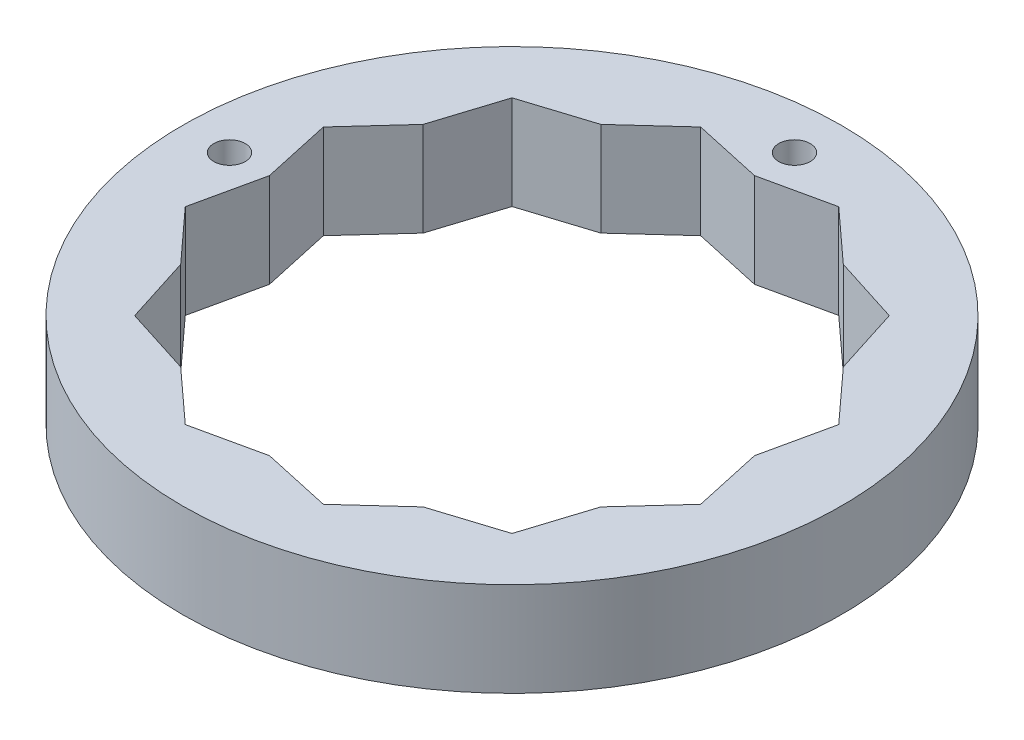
ISO-10303-21;
HEADER;
FILE_DESCRIPTION(('STEP AP214'),'2;1');
FILE_NAME('part.step','',(''),(''),'','','');
FILE_SCHEMA(('AUTOMOTIVE_DESIGN { 1 0 10303 214 1 1 1 1 }'));
ENDSEC;
DATA;
#1=APPLICATION_CONTEXT('core data for automotive mechanical design processes');
#2=APPLICATION_PROTOCOL_DEFINITION('international standard','automotive_design',2000,#1);
#3=PRODUCT_CONTEXT('',#1,'mechanical');
#4=PRODUCT('Part','Part','',(#3));
#5=PRODUCT_RELATED_PRODUCT_CATEGORY('part','',(#4));
#6=PRODUCT_DEFINITION_FORMATION('','',#4);
#7=PRODUCT_DEFINITION_CONTEXT('part definition',#1,'design');
#8=PRODUCT_DEFINITION('design','',#6,#7);
#9=PRODUCT_DEFINITION_SHAPE('','',#8);
#10=(LENGTH_UNIT() NAMED_UNIT(*) SI_UNIT(.MILLI.,.METRE.));
#11=(NAMED_UNIT(*) PLANE_ANGLE_UNIT() SI_UNIT($,.RADIAN.));
#12=(NAMED_UNIT(*) SI_UNIT($,.STERADIAN.) SOLID_ANGLE_UNIT());
#13=UNCERTAINTY_MEASURE_WITH_UNIT(LENGTH_MEASURE(1.E-05),#10,'distance_accuracy_value','');
#14=(GEOMETRIC_REPRESENTATION_CONTEXT(3) GLOBAL_UNCERTAINTY_ASSIGNED_CONTEXT((#13)) GLOBAL_UNIT_ASSIGNED_CONTEXT((#10,
#11,#12)) REPRESENTATION_CONTEXT('',''));
#15=CARTESIAN_POINT('',(0.,0.,0.));
#16=DIRECTION('',(0.,0.,1.));
#17=DIRECTION('',(1.,0.,0.));
#18=AXIS2_PLACEMENT_3D('',#15,#16,#17);
#19=CARTESIAN_POINT('',(0.,3.,0.));
#20=DIRECTION('',(0.,1.,0.));
#21=DIRECTION('',(0.,0.,1.));
#22=AXIS2_PLACEMENT_3D('',#19,#20,#21);
#23=PLANE('',#22);
#24=CARTESIAN_POINT('',(0.,3.,-9.));
#25=DIRECTION('',(0.,1.,0.));
#26=DIRECTION('',(0.,0.,1.));
#27=AXIS2_PLACEMENT_3D('',#24,#25,#26);
#28=CIRCLE('',#27,0.5);
#29=CARTESIAN_POINT('',(0.,3.,-8.5));
#30=VERTEX_POINT('',#29);
#31=EDGE_CURVE('E266',#30,#30,#28,.T.);
#32=ORIENTED_EDGE('',*,*,#31,.F.);
#33=EDGE_LOOP('',(#32));
#34=FACE_BOUND('',#33,.T.);
#35=CARTESIAN_POINT('',(0.,3.,0.));
#36=DIRECTION('',(0.,1.,0.));
#37=DIRECTION('',(0.,0.,1.));
#38=AXIS2_PLACEMENT_3D('',#35,#36,#37);
#39=CIRCLE('',#38,10.5);
#40=CARTESIAN_POINT('',(0.,3.,10.5));
#41=VERTEX_POINT('',#40);
#42=EDGE_CURVE('E11',#41,#41,#39,.T.);
#43=ORIENTED_EDGE('',*,*,#42,.T.);
#44=EDGE_LOOP('',(#43));
#45=FACE_BOUND('',#44,.T.);
#46=DIRECTION('',(-0.976740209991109,0.,0.214426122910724));
#47=VECTOR('',#46,1.);
#48=CARTESIAN_POINT('',(0.,3.,-7.72740661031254));
#49=LINE('',#48,#47);
#50=CARTESIAN_POINT('',(2.19996188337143,3.,-8.21036952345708));
#51=VERTEX_POINT('',#50);
#52=CARTESIAN_POINT('',(0.,3.,-7.72740661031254));
#53=VERTEX_POINT('',#52);
#54=EDGE_CURVE('E205',#51,#53,#49,.T.);
#55=ORIENTED_EDGE('',*,*,#54,.F.);
#56=DIRECTION('',(-0.738668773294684,0.,-0.674068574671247));
#57=VECTOR('',#56,1.);
#58=CARTESIAN_POINT('',(2.19996188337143,3.,-8.21036952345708));
#59=LINE('',#58,#57);
#60=CARTESIAN_POINT('',(3.86370330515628,3.,-6.69213042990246));
#61=VERTEX_POINT('',#60);
#62=EDGE_CURVE('E197',#61,#51,#59,.T.);
#63=ORIENTED_EDGE('',*,*,#62,.F.);
#64=DIRECTION('',(-0.95309489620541,0.,-0.302671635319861));
#65=VECTOR('',#64,1.);
#66=CARTESIAN_POINT('',(3.86370330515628,3.,-6.69213042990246));
#67=LINE('',#66,#65);
#68=CARTESIAN_POINT('',(6.01040764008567,3.,-6.01040764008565));
#69=VERTEX_POINT('',#68);
#70=EDGE_CURVE('E263',#69,#61,#67,.T.);
#71=ORIENTED_EDGE('',*,*,#70,.F.);
#72=DIRECTION('',(-0.302671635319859,0.,-0.953094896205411));
#73=VECTOR('',#72,1.);
#74=CARTESIAN_POINT('',(6.01040764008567,3.,-6.01040764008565));
#75=LINE('',#74,#73);
#76=CARTESIAN_POINT('',(6.69213042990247,3.,-3.86370330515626));
#77=VERTEX_POINT('',#76);
#78=EDGE_CURVE('E261',#77,#69,#75,.T.);
#79=ORIENTED_EDGE('',*,*,#78,.F.);
#80=DIRECTION('',(-0.674068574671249,0.,-0.738668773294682));
#81=VECTOR('',#80,1.);
#82=CARTESIAN_POINT('',(6.69213042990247,3.,-3.86370330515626));
#83=LINE('',#82,#81);
#84=CARTESIAN_POINT('',(8.2103695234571,3.,-2.19996188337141));
#85=VERTEX_POINT('',#84);
#86=EDGE_CURVE('E259',#85,#77,#83,.T.);
#87=ORIENTED_EDGE('',*,*,#86,.F.);
#88=DIRECTION('',(0.214426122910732,0.,-0.976740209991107));
#89=VECTOR('',#88,1.);
#90=CARTESIAN_POINT('',(8.2103695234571,3.,-2.19996188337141));
#91=LINE('',#90,#89);
#92=CARTESIAN_POINT('',(7.72740661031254,3.,0.));
#93=VERTEX_POINT('',#92);
#94=EDGE_CURVE('E257',#93,#85,#91,.T.);
#95=ORIENTED_EDGE('',*,*,#94,.F.);
#96=DIRECTION('',(-0.214426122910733,0.,-0.976740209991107));
#97=VECTOR('',#96,1.);
#98=CARTESIAN_POINT('',(7.72740661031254,3.,0.));
#99=LINE('',#98,#97);
#100=CARTESIAN_POINT('',(8.2103695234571,3.,2.19996188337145));
#101=VERTEX_POINT('',#100);
#102=EDGE_CURVE('E255',#101,#93,#99,.T.);
#103=ORIENTED_EDGE('',*,*,#102,.F.);
#104=DIRECTION('',(0.674068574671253,0.,-0.738668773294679));
#105=VECTOR('',#104,1.);
#106=CARTESIAN_POINT('',(8.2103695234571,3.,2.19996188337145));
#107=LINE('',#106,#105);
#108=CARTESIAN_POINT('',(6.69213042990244,3.,3.8637033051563));
#109=VERTEX_POINT('',#108);
#110=EDGE_CURVE('E253',#109,#101,#107,.T.);
#111=ORIENTED_EDGE('',*,*,#110,.F.);
#112=DIRECTION('',(0.302671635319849,0.,-0.953094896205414));
#113=VECTOR('',#112,1.);
#114=CARTESIAN_POINT('',(6.69213042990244,3.,3.8637033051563));
#115=LINE('',#114,#113);
#116=CARTESIAN_POINT('',(6.01040764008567,3.,6.01040764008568));
#117=VERTEX_POINT('',#116);
#118=EDGE_CURVE('E251',#117,#109,#115,.T.);
#119=ORIENTED_EDGE('',*,*,#118,.F.);
#120=DIRECTION('',(0.953094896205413,0.,-0.302671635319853));
#121=VECTOR('',#120,1.);
#122=CARTESIAN_POINT('',(6.01040764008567,3.,6.01040764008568));
#123=LINE('',#122,#121);
#124=CARTESIAN_POINT('',(3.86370330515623,3.,6.69213042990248));
#125=VERTEX_POINT('',#124);
#126=EDGE_CURVE('E249',#125,#117,#123,.T.);
#127=ORIENTED_EDGE('',*,*,#126,.F.);
#128=DIRECTION('',(0.738668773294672,0.,-0.67406857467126));
#129=VECTOR('',#128,1.);
#130=CARTESIAN_POINT('',(3.86370330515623,3.,6.69213042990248));
#131=LINE('',#130,#129);
#132=CARTESIAN_POINT('',(2.19996188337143,3.,8.21036952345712));
#133=VERTEX_POINT('',#132);
#134=EDGE_CURVE('E247',#133,#125,#131,.T.);
#135=ORIENTED_EDGE('',*,*,#134,.F.);
#136=DIRECTION('',(0.976740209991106,0.,0.214426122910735));
#137=VECTOR('',#136,1.);
#138=CARTESIAN_POINT('',(2.19996188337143,3.,8.21036952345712));
#139=LINE('',#138,#137);
#140=CARTESIAN_POINT('',(0.,3.,7.72740661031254));
#141=VERTEX_POINT('',#140);
#142=EDGE_CURVE('E245',#141,#133,#139,.T.);
#143=ORIENTED_EDGE('',*,*,#142,.F.);
#144=DIRECTION('',(0.976740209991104,0.,-0.214426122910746));
#145=VECTOR('',#144,1.);
#146=CARTESIAN_POINT('',(0.,3.,7.72740661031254));
#147=LINE('',#146,#145);
#148=CARTESIAN_POINT('',(-2.19996188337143,3.,8.21036952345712));
#149=VERTEX_POINT('',#148);
#150=EDGE_CURVE('E243',#149,#141,#147,.T.);
#151=ORIENTED_EDGE('',*,*,#150,.F.);
#152=DIRECTION('',(0.73866877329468,0.,0.674068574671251));
#153=VECTOR('',#152,1.);
#154=CARTESIAN_POINT('',(-2.19996188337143,3.,8.21036952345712));
#155=LINE('',#154,#153);
#156=CARTESIAN_POINT('',(-3.86370330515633,3.,6.69213042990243));
#157=VERTEX_POINT('',#156);
#158=EDGE_CURVE('E241',#157,#149,#155,.T.);
#159=ORIENTED_EDGE('',*,*,#158,.F.);
#160=DIRECTION('',(0.953094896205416,0.,0.302671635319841));
#161=VECTOR('',#160,1.);
#162=CARTESIAN_POINT('',(-3.86370330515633,3.,6.69213042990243));
#163=LINE('',#162,#161);
#164=CARTESIAN_POINT('',(-6.01040764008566,3.,6.01040764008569));
#165=VERTEX_POINT('',#164);
#166=EDGE_CURVE('E239',#165,#157,#163,.T.);
#167=ORIENTED_EDGE('',*,*,#166,.F.);
#168=DIRECTION('',(0.30267163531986,0.,0.95309489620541));
#169=VECTOR('',#168,1.);
#170=CARTESIAN_POINT('',(-6.01040764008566,3.,6.01040764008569));
#171=LINE('',#170,#169);
#172=CARTESIAN_POINT('',(-6.6921304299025,3.,3.86370330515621));
#173=VERTEX_POINT('',#172);
#174=EDGE_CURVE('E237',#173,#165,#171,.T.);
#175=ORIENTED_EDGE('',*,*,#174,.F.);
#176=DIRECTION('',(0.674068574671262,0.,0.738668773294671));
#177=VECTOR('',#176,1.);
#178=CARTESIAN_POINT('',(-6.6921304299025,3.,3.86370330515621));
#179=LINE('',#178,#177);
#180=CARTESIAN_POINT('',(-8.2103695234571,3.,2.19996188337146));
#181=VERTEX_POINT('',#180);
#182=EDGE_CURVE('E235',#181,#173,#179,.T.);
#183=ORIENTED_EDGE('',*,*,#182,.F.);
#184=DIRECTION('',(-0.21442612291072,0.,0.97674020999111));
#185=VECTOR('',#184,1.);
#186=CARTESIAN_POINT('',(-8.2103695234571,3.,2.19996188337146));
#187=LINE('',#186,#185);
#188=CARTESIAN_POINT('',(-7.72740661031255,3.,0.));
#189=VERTEX_POINT('',#188);
#190=EDGE_CURVE('E233',#189,#181,#187,.T.);
#191=ORIENTED_EDGE('',*,*,#190,.F.);
#192=DIRECTION('',(0.214426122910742,0.,0.976740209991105));
#193=VECTOR('',#192,1.);
#194=CARTESIAN_POINT('',(-7.72740661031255,3.,0.));
#195=LINE('',#194,#193);
#196=CARTESIAN_POINT('',(-8.2103695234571,3.,-2.1999618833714));
#197=VERTEX_POINT('',#196);
#198=EDGE_CURVE('E231',#197,#189,#195,.T.);
#199=ORIENTED_EDGE('',*,*,#198,.F.);
#200=DIRECTION('',(-0.67406857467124,0.,0.738668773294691));
#201=VECTOR('',#200,1.);
#202=CARTESIAN_POINT('',(-8.2103695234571,3.,-2.1999618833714));
#203=LINE('',#202,#201);
#204=CARTESIAN_POINT('',(-6.69213042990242,3.,-3.86370330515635));
#205=VERTEX_POINT('',#204);
#206=EDGE_CURVE('E229',#205,#197,#203,.T.);
#207=ORIENTED_EDGE('',*,*,#206,.F.);
#208=DIRECTION('',(-0.302671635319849,0.,0.953094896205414));
#209=VECTOR('',#208,1.);
#210=CARTESIAN_POINT('',(-6.69213042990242,3.,-3.86370330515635));
#211=LINE('',#210,#209);
#212=CARTESIAN_POINT('',(-6.01040764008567,3.,-6.01040764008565));
#213=VERTEX_POINT('',#212);
#214=EDGE_CURVE('E227',#213,#205,#211,.T.);
#215=ORIENTED_EDGE('',*,*,#214,.F.);
#216=DIRECTION('',(-0.953094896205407,0.,0.302671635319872));
#217=VECTOR('',#216,1.);
#218=CARTESIAN_POINT('',(-6.01040764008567,3.,-6.01040764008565));
#219=LINE('',#218,#217);
#220=CARTESIAN_POINT('',(-3.86370330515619,3.,-6.69213042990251));
#221=VERTEX_POINT('',#220);
#222=EDGE_CURVE('E225',#221,#213,#219,.T.);
#223=ORIENTED_EDGE('',*,*,#222,.F.);
#224=DIRECTION('',(-0.738668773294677,0.,0.674068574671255));
#225=VECTOR('',#224,1.);
#226=CARTESIAN_POINT('',(-3.86370330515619,3.,-6.69213042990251));
#227=LINE('',#226,#225);
#228=CARTESIAN_POINT('',(-2.19996188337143,3.,-8.21036952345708));
#229=VERTEX_POINT('',#228);
#230=EDGE_CURVE('E220',#229,#221,#227,.T.);
#231=ORIENTED_EDGE('',*,*,#230,.F.);
#232=DIRECTION('',(-0.976740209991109,0.,-0.214426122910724));
#233=VECTOR('',#232,1.);
#234=CARTESIAN_POINT('',(-2.19996188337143,3.,-8.21036952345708));
#235=LINE('',#234,#233);
#236=EDGE_CURVE('E218',#53,#229,#235,.T.);
#237=ORIENTED_EDGE('',*,*,#236,.F.);
#238=EDGE_LOOP('',(#55,#63,#71,#79,#87,#95,#103,#111,#119,#127,#135,#143,#151,#159,#167,#175,
#183,#191,#199,#207,#215,#223,#231,#237));
#239=FACE_BOUND('',#238,.T.);
#240=CARTESIAN_POINT('',(-9.,3.,0.));
#241=DIRECTION('',(0.,1.,0.));
#242=DIRECTION('',(0.,0.,1.));
#243=AXIS2_PLACEMENT_3D('',#240,#241,#242);
#244=CIRCLE('',#243,0.500000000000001);
#245=CARTESIAN_POINT('',(-9.,3.,0.500000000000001));
#246=VERTEX_POINT('',#245);
#247=EDGE_CURVE('E710',#246,#246,#244,.T.);
#248=ORIENTED_EDGE('',*,*,#247,.F.);
#249=EDGE_LOOP('',(#248));
#250=FACE_BOUND('',#249,.T.);
#251=ADVANCED_FACE('F36',(#34,#45,#239,#250),#23,.T.);
#252=CARTESIAN_POINT('',(0.,0.,0.));
#253=DIRECTION('',(0.,1.,0.));
#254=DIRECTION('',(0.,0.,1.));
#255=AXIS2_PLACEMENT_3D('',#252,#253,#254);
#256=PLANE('',#255);
#257=CARTESIAN_POINT('',(0.,0.,-9.));
#258=DIRECTION('',(0.,1.,0.));
#259=DIRECTION('',(0.,0.,1.));
#260=AXIS2_PLACEMENT_3D('',#257,#258,#259);
#261=CIRCLE('',#260,0.5);
#262=CARTESIAN_POINT('',(0.,0.,-8.5));
#263=VERTEX_POINT('',#262);
#264=EDGE_CURVE('E715',#263,#263,#261,.T.);
#265=ORIENTED_EDGE('',*,*,#264,.T.);
#266=EDGE_LOOP('',(#265));
#267=FACE_BOUND('',#266,.T.);
#268=CARTESIAN_POINT('',(0.,0.,0.));
#269=DIRECTION('',(0.,1.,0.));
#270=DIRECTION('',(0.,0.,1.));
#271=AXIS2_PLACEMENT_3D('',#268,#269,#270);
#272=CIRCLE('',#271,10.5);
#273=CARTESIAN_POINT('',(0.,0.,10.5));
#274=VERTEX_POINT('',#273);
#275=EDGE_CURVE('E40',#274,#274,#272,.T.);
#276=ORIENTED_EDGE('',*,*,#275,.F.);
#277=EDGE_LOOP('',(#276));
#278=FACE_BOUND('',#277,.T.);
#279=DIRECTION('',(-0.738668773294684,0.,-0.674068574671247));
#280=VECTOR('',#279,1.);
#281=CARTESIAN_POINT('',(2.19996188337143,0.,-8.21036952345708));
#282=LINE('',#281,#280);
#283=CARTESIAN_POINT('',(3.86370330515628,0.,-6.69213042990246));
#284=VERTEX_POINT('',#283);
#285=CARTESIAN_POINT('',(2.19996188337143,0.,-8.21036952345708));
#286=VERTEX_POINT('',#285);
#287=EDGE_CURVE('E59',#284,#286,#282,.T.);
#288=ORIENTED_EDGE('',*,*,#287,.T.);
#289=DIRECTION('',(-0.976740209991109,0.,0.214426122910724));
#290=VECTOR('',#289,1.);
#291=CARTESIAN_POINT('',(0.,0.,-7.72740661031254));
#292=LINE('',#291,#290);
#293=CARTESIAN_POINT('',(0.,0.,-7.72740661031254));
#294=VERTEX_POINT('',#293);
#295=EDGE_CURVE('E212',#286,#294,#292,.T.);
#296=ORIENTED_EDGE('',*,*,#295,.T.);
#297=DIRECTION('',(-0.976740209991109,0.,-0.214426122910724));
#298=VECTOR('',#297,1.);
#299=CARTESIAN_POINT('',(-2.19996188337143,0.,-8.21036952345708));
#300=LINE('',#299,#298);
#301=CARTESIAN_POINT('',(-2.19996188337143,0.,-8.21036952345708));
#302=VERTEX_POINT('',#301);
#303=EDGE_CURVE('E268',#294,#302,#300,.T.);
#304=ORIENTED_EDGE('',*,*,#303,.T.);
#305=DIRECTION('',(-0.738668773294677,0.,0.674068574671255));
#306=VECTOR('',#305,1.);
#307=CARTESIAN_POINT('',(-3.86370330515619,0.,-6.69213042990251));
#308=LINE('',#307,#306);
#309=CARTESIAN_POINT('',(-3.86370330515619,0.,-6.69213042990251));
#310=VERTEX_POINT('',#309);
#311=EDGE_CURVE('E271',#302,#310,#308,.T.);
#312=ORIENTED_EDGE('',*,*,#311,.T.);
#313=DIRECTION('',(-0.953094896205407,0.,0.302671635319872));
#314=VECTOR('',#313,1.);
#315=CARTESIAN_POINT('',(-6.01040764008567,0.,-6.01040764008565));
#316=LINE('',#315,#314);
#317=CARTESIAN_POINT('',(-6.01040764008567,0.,-6.01040764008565));
#318=VERTEX_POINT('',#317);
#319=EDGE_CURVE('E274',#310,#318,#316,.T.);
#320=ORIENTED_EDGE('',*,*,#319,.T.);
#321=DIRECTION('',(-0.302671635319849,0.,0.953094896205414));
#322=VECTOR('',#321,1.);
#323=CARTESIAN_POINT('',(-6.69213042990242,0.,-3.86370330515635));
#324=LINE('',#323,#322);
#325=CARTESIAN_POINT('',(-6.69213042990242,0.,-3.86370330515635));
#326=VERTEX_POINT('',#325);
#327=EDGE_CURVE('E277',#318,#326,#324,.T.);
#328=ORIENTED_EDGE('',*,*,#327,.T.);
#329=DIRECTION('',(-0.67406857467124,0.,0.738668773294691));
#330=VECTOR('',#329,1.);
#331=CARTESIAN_POINT('',(-8.2103695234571,0.,-2.1999618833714));
#332=LINE('',#331,#330);
#333=CARTESIAN_POINT('',(-8.2103695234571,0.,-2.1999618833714));
#334=VERTEX_POINT('',#333);
#335=EDGE_CURVE('E280',#326,#334,#332,.T.);
#336=ORIENTED_EDGE('',*,*,#335,.T.);
#337=DIRECTION('',(0.214426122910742,0.,0.976740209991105));
#338=VECTOR('',#337,1.);
#339=CARTESIAN_POINT('',(-7.72740661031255,0.,0.));
#340=LINE('',#339,#338);
#341=CARTESIAN_POINT('',(-7.72740661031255,0.,0.));
#342=VERTEX_POINT('',#341);
#343=EDGE_CURVE('E283',#334,#342,#340,.T.);
#344=ORIENTED_EDGE('',*,*,#343,.T.);
#345=DIRECTION('',(-0.21442612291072,0.,0.97674020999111));
#346=VECTOR('',#345,1.);
#347=CARTESIAN_POINT('',(-8.2103695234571,0.,2.19996188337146));
#348=LINE('',#347,#346);
#349=CARTESIAN_POINT('',(-8.2103695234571,0.,2.19996188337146));
#350=VERTEX_POINT('',#349);
#351=EDGE_CURVE('E286',#342,#350,#348,.T.);
#352=ORIENTED_EDGE('',*,*,#351,.T.);
#353=DIRECTION('',(0.674068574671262,0.,0.738668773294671));
#354=VECTOR('',#353,1.);
#355=CARTESIAN_POINT('',(-6.6921304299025,0.,3.86370330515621));
#356=LINE('',#355,#354);
#357=CARTESIAN_POINT('',(-6.6921304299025,0.,3.86370330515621));
#358=VERTEX_POINT('',#357);
#359=EDGE_CURVE('E289',#350,#358,#356,.T.);
#360=ORIENTED_EDGE('',*,*,#359,.T.);
#361=DIRECTION('',(0.30267163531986,0.,0.95309489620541));
#362=VECTOR('',#361,1.);
#363=CARTESIAN_POINT('',(-6.01040764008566,0.,6.01040764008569));
#364=LINE('',#363,#362);
#365=CARTESIAN_POINT('',(-6.01040764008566,0.,6.01040764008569));
#366=VERTEX_POINT('',#365);
#367=EDGE_CURVE('E292',#358,#366,#364,.T.);
#368=ORIENTED_EDGE('',*,*,#367,.T.);
#369=DIRECTION('',(0.953094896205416,0.,0.302671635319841));
#370=VECTOR('',#369,1.);
#371=CARTESIAN_POINT('',(-3.86370330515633,0.,6.69213042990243));
#372=LINE('',#371,#370);
#373=CARTESIAN_POINT('',(-3.86370330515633,0.,6.69213042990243));
#374=VERTEX_POINT('',#373);
#375=EDGE_CURVE('E295',#366,#374,#372,.T.);
#376=ORIENTED_EDGE('',*,*,#375,.T.);
#377=DIRECTION('',(0.73866877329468,0.,0.674068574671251));
#378=VECTOR('',#377,1.);
#379=CARTESIAN_POINT('',(-2.19996188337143,0.,8.21036952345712));
#380=LINE('',#379,#378);
#381=CARTESIAN_POINT('',(-2.19996188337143,0.,8.21036952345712));
#382=VERTEX_POINT('',#381);
#383=EDGE_CURVE('E298',#374,#382,#380,.T.);
#384=ORIENTED_EDGE('',*,*,#383,.T.);
#385=DIRECTION('',(0.976740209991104,0.,-0.214426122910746));
#386=VECTOR('',#385,1.);
#387=CARTESIAN_POINT('',(0.,0.,7.72740661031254));
#388=LINE('',#387,#386);
#389=CARTESIAN_POINT('',(0.,0.,7.72740661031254));
#390=VERTEX_POINT('',#389);
#391=EDGE_CURVE('E301',#382,#390,#388,.T.);
#392=ORIENTED_EDGE('',*,*,#391,.T.);
#393=DIRECTION('',(0.976740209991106,0.,0.214426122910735));
#394=VECTOR('',#393,1.);
#395=CARTESIAN_POINT('',(2.19996188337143,0.,8.21036952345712));
#396=LINE('',#395,#394);
#397=CARTESIAN_POINT('',(2.19996188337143,0.,8.21036952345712));
#398=VERTEX_POINT('',#397);
#399=EDGE_CURVE('E304',#390,#398,#396,.T.);
#400=ORIENTED_EDGE('',*,*,#399,.T.);
#401=DIRECTION('',(0.738668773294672,0.,-0.67406857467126));
#402=VECTOR('',#401,1.);
#403=CARTESIAN_POINT('',(3.86370330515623,0.,6.69213042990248));
#404=LINE('',#403,#402);
#405=CARTESIAN_POINT('',(3.86370330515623,0.,6.69213042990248));
#406=VERTEX_POINT('',#405);
#407=EDGE_CURVE('E307',#398,#406,#404,.T.);
#408=ORIENTED_EDGE('',*,*,#407,.T.);
#409=DIRECTION('',(0.953094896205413,0.,-0.302671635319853));
#410=VECTOR('',#409,1.);
#411=CARTESIAN_POINT('',(6.01040764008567,0.,6.01040764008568));
#412=LINE('',#411,#410);
#413=CARTESIAN_POINT('',(6.01040764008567,0.,6.01040764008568));
#414=VERTEX_POINT('',#413);
#415=EDGE_CURVE('E310',#406,#414,#412,.T.);
#416=ORIENTED_EDGE('',*,*,#415,.T.);
#417=DIRECTION('',(0.302671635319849,0.,-0.953094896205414));
#418=VECTOR('',#417,1.);
#419=CARTESIAN_POINT('',(6.69213042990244,0.,3.8637033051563));
#420=LINE('',#419,#418);
#421=CARTESIAN_POINT('',(6.69213042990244,0.,3.8637033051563));
#422=VERTEX_POINT('',#421);
#423=EDGE_CURVE('E313',#414,#422,#420,.T.);
#424=ORIENTED_EDGE('',*,*,#423,.T.);
#425=DIRECTION('',(0.674068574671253,0.,-0.738668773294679));
#426=VECTOR('',#425,1.);
#427=CARTESIAN_POINT('',(8.2103695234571,0.,2.19996188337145));
#428=LINE('',#427,#426);
#429=CARTESIAN_POINT('',(8.2103695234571,0.,2.19996188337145));
#430=VERTEX_POINT('',#429);
#431=EDGE_CURVE('E316',#422,#430,#428,.T.);
#432=ORIENTED_EDGE('',*,*,#431,.T.);
#433=DIRECTION('',(-0.214426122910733,0.,-0.976740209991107));
#434=VECTOR('',#433,1.);
#435=CARTESIAN_POINT('',(7.72740661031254,0.,0.));
#436=LINE('',#435,#434);
#437=CARTESIAN_POINT('',(7.72740661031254,0.,0.));
#438=VERTEX_POINT('',#437);
#439=EDGE_CURVE('E319',#430,#438,#436,.T.);
#440=ORIENTED_EDGE('',*,*,#439,.T.);
#441=DIRECTION('',(0.214426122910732,0.,-0.976740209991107));
#442=VECTOR('',#441,1.);
#443=CARTESIAN_POINT('',(8.2103695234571,0.,-2.19996188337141));
#444=LINE('',#443,#442);
#445=CARTESIAN_POINT('',(8.2103695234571,0.,-2.19996188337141));
#446=VERTEX_POINT('',#445);
#447=EDGE_CURVE('E322',#438,#446,#444,.T.);
#448=ORIENTED_EDGE('',*,*,#447,.T.);
#449=DIRECTION('',(-0.674068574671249,0.,-0.738668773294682));
#450=VECTOR('',#449,1.);
#451=CARTESIAN_POINT('',(6.69213042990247,0.,-3.86370330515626));
#452=LINE('',#451,#450);
#453=CARTESIAN_POINT('',(6.69213042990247,0.,-3.86370330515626));
#454=VERTEX_POINT('',#453);
#455=EDGE_CURVE('E325',#446,#454,#452,.T.);
#456=ORIENTED_EDGE('',*,*,#455,.T.);
#457=DIRECTION('',(-0.302671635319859,0.,-0.953094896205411));
#458=VECTOR('',#457,1.);
#459=CARTESIAN_POINT('',(6.01040764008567,0.,-6.01040764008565));
#460=LINE('',#459,#458);
#461=CARTESIAN_POINT('',(6.01040764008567,0.,-6.01040764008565));
#462=VERTEX_POINT('',#461);
#463=EDGE_CURVE('E328',#454,#462,#460,.T.);
#464=ORIENTED_EDGE('',*,*,#463,.T.);
#465=DIRECTION('',(-0.95309489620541,0.,-0.302671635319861));
#466=VECTOR('',#465,1.);
#467=CARTESIAN_POINT('',(3.86370330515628,0.,-6.69213042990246));
#468=LINE('',#467,#466);
#469=EDGE_CURVE('E206',#462,#284,#468,.T.);
#470=ORIENTED_EDGE('',*,*,#469,.T.);
#471=EDGE_LOOP('',(#288,#296,#304,#312,#320,#328,#336,#344,#352,#360,#368,#376,#384,#392,#400,
#408,#416,#424,#432,#440,#448,#456,#464,#470));
#472=FACE_BOUND('',#471,.T.);
#473=CARTESIAN_POINT('',(-9.,0.,0.));
#474=DIRECTION('',(0.,1.,0.));
#475=DIRECTION('',(0.,0.,1.));
#476=AXIS2_PLACEMENT_3D('',#473,#474,#475);
#477=CIRCLE('',#476,0.500000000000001);
#478=CARTESIAN_POINT('',(-9.,0.,0.500000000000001));
#479=VERTEX_POINT('',#478);
#480=EDGE_CURVE('E713',#479,#479,#477,.T.);
#481=ORIENTED_EDGE('',*,*,#480,.T.);
#482=EDGE_LOOP('',(#481));
#483=FACE_BOUND('',#482,.T.);
#484=ADVANCED_FACE('F381',(#267,#278,#472,#483),#256,.F.);
#485=CARTESIAN_POINT('',(0.,3.,0.));
#486=DIRECTION('',(0.,-1.,0.));
#487=DIRECTION('',(0.,0.,-1.));
#488=AXIS2_PLACEMENT_3D('',#485,#486,#487);
#489=CYLINDRICAL_SURFACE('',#488,10.5);
#490=ORIENTED_EDGE('',*,*,#42,.F.);
#491=EDGE_LOOP('',(#490));
#492=FACE_BOUND('',#491,.T.);
#493=ORIENTED_EDGE('',*,*,#275,.T.);
#494=EDGE_LOOP('',(#493));
#495=FACE_BOUND('',#494,.T.);
#496=ADVANCED_FACE('F38',(#492,#495),#489,.T.);
#497=CARTESIAN_POINT('',(2.19996188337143,3.,-8.21036952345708));
#498=DIRECTION('',(-0.674068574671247,0.,0.738668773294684));
#499=DIRECTION('',(0.738668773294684,0.,0.674068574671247));
#500=AXIS2_PLACEMENT_3D('',#497,#498,#499);
#501=PLANE('',#500);
#502=ORIENTED_EDGE('',*,*,#287,.F.);
#503=DIRECTION('',(0.,-1.,0.));
#504=VECTOR('',#503,1.);
#505=CARTESIAN_POINT('',(3.86370330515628,3.,-6.69213042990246));
#506=LINE('',#505,#504);
#507=EDGE_CURVE('E201',#61,#284,#506,.T.);
#508=ORIENTED_EDGE('',*,*,#507,.F.);
#509=ORIENTED_EDGE('',*,*,#62,.T.);
#510=DIRECTION('',(0.,-1.,0.));
#511=VECTOR('',#510,1.);
#512=CARTESIAN_POINT('',(2.19996188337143,3.,-8.21036952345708));
#513=LINE('',#512,#511);
#514=EDGE_CURVE('E200',#51,#286,#513,.T.);
#515=ORIENTED_EDGE('',*,*,#514,.T.);
#516=EDGE_LOOP('',(#502,#508,#509,#515));
#517=FACE_BOUND('',#516,.T.);
#518=ADVANCED_FACE('F199',(#517),#501,.T.);
#519=CARTESIAN_POINT('',(0.,3.,-7.72740661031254));
#520=DIRECTION('',(0.214426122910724,0.,0.976740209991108));
#521=DIRECTION('',(0.976740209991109,0.,-0.214426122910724));
#522=AXIS2_PLACEMENT_3D('',#519,#520,#521);
#523=PLANE('',#522);
#524=ORIENTED_EDGE('',*,*,#295,.F.);
#525=ORIENTED_EDGE('',*,*,#514,.F.);
#526=ORIENTED_EDGE('',*,*,#54,.T.);
#527=DIRECTION('',(0.,-1.,0.));
#528=VECTOR('',#527,1.);
#529=CARTESIAN_POINT('',(0.,3.,-7.72740661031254));
#530=LINE('',#529,#528);
#531=EDGE_CURVE('E213',#53,#294,#530,.T.);
#532=ORIENTED_EDGE('',*,*,#531,.T.);
#533=EDGE_LOOP('',(#524,#525,#526,#532));
#534=FACE_BOUND('',#533,.T.);
#535=ADVANCED_FACE('F209',(#534),#523,.T.);
#536=CARTESIAN_POINT('',(-2.19996188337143,3.,-8.21036952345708));
#537=DIRECTION('',(-0.214426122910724,0.,0.976740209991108));
#538=DIRECTION('',(0.976740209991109,0.,0.214426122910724));
#539=AXIS2_PLACEMENT_3D('',#536,#537,#538);
#540=PLANE('',#539);
#541=ORIENTED_EDGE('',*,*,#303,.F.);
#542=ORIENTED_EDGE('',*,*,#531,.F.);
#543=ORIENTED_EDGE('',*,*,#236,.T.);
#544=DIRECTION('',(0.,-1.,0.));
#545=VECTOR('',#544,1.);
#546=CARTESIAN_POINT('',(-2.19996188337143,3.,-8.21036952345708));
#547=LINE('',#546,#545);
#548=EDGE_CURVE('E373',#229,#302,#547,.T.);
#549=ORIENTED_EDGE('',*,*,#548,.T.);
#550=EDGE_LOOP('',(#541,#542,#543,#549));
#551=FACE_BOUND('',#550,.T.);
#552=ADVANCED_FACE('F377',(#551),#540,.T.);
#553=CARTESIAN_POINT('',(-3.86370330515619,3.,-6.69213042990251));
#554=DIRECTION('',(0.674068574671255,0.,0.738668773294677));
#555=DIRECTION('',(0.738668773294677,0.,-0.674068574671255));
#556=AXIS2_PLACEMENT_3D('',#553,#554,#555);
#557=PLANE('',#556);
#558=ORIENTED_EDGE('',*,*,#311,.F.);
#559=ORIENTED_EDGE('',*,*,#548,.F.);
#560=ORIENTED_EDGE('',*,*,#230,.T.);
#561=DIRECTION('',(0.,-1.,0.));
#562=VECTOR('',#561,1.);
#563=CARTESIAN_POINT('',(-3.86370330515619,3.,-6.69213042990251));
#564=LINE('',#563,#562);
#565=EDGE_CURVE('E371',#221,#310,#564,.T.);
#566=ORIENTED_EDGE('',*,*,#565,.T.);
#567=EDGE_LOOP('',(#558,#559,#560,#566));
#568=FACE_BOUND('',#567,.T.);
#569=ADVANCED_FACE('F480',(#568),#557,.T.);
#570=CARTESIAN_POINT('',(-6.01040764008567,3.,-6.01040764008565));
#571=DIRECTION('',(0.302671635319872,0.,0.953094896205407));
#572=DIRECTION('',(0.953094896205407,0.,-0.302671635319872));
#573=AXIS2_PLACEMENT_3D('',#570,#571,#572);
#574=PLANE('',#573);
#575=ORIENTED_EDGE('',*,*,#319,.F.);
#576=ORIENTED_EDGE('',*,*,#565,.F.);
#577=ORIENTED_EDGE('',*,*,#222,.T.);
#578=DIRECTION('',(0.,-1.,0.));
#579=VECTOR('',#578,1.);
#580=CARTESIAN_POINT('',(-6.01040764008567,3.,-6.01040764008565));
#581=LINE('',#580,#579);
#582=EDGE_CURVE('E369',#213,#318,#581,.T.);
#583=ORIENTED_EDGE('',*,*,#582,.T.);
#584=EDGE_LOOP('',(#575,#576,#577,#583));
#585=FACE_BOUND('',#584,.T.);
#586=ADVANCED_FACE('F478',(#585),#574,.T.);
#587=CARTESIAN_POINT('',(-6.69213042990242,3.,-3.86370330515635));
#588=DIRECTION('',(0.953094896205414,0.,0.302671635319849));
#589=DIRECTION('',(0.302671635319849,0.,-0.953094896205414));
#590=AXIS2_PLACEMENT_3D('',#587,#588,#589);
#591=PLANE('',#590);
#592=ORIENTED_EDGE('',*,*,#327,.F.);
#593=ORIENTED_EDGE('',*,*,#582,.F.);
#594=ORIENTED_EDGE('',*,*,#214,.T.);
#595=DIRECTION('',(0.,-1.,0.));
#596=VECTOR('',#595,1.);
#597=CARTESIAN_POINT('',(-6.69213042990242,3.,-3.86370330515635));
#598=LINE('',#597,#596);
#599=EDGE_CURVE('E367',#205,#326,#598,.T.);
#600=ORIENTED_EDGE('',*,*,#599,.T.);
#601=EDGE_LOOP('',(#592,#593,#594,#600));
#602=FACE_BOUND('',#601,.T.);
#603=ADVANCED_FACE('F472',(#602),#591,.T.);
#604=CARTESIAN_POINT('',(-8.2103695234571,3.,-2.1999618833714));
#605=DIRECTION('',(0.738668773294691,0.,0.67406857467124));
#606=DIRECTION('',(0.67406857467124,0.,-0.738668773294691));
#607=AXIS2_PLACEMENT_3D('',#604,#605,#606);
#608=PLANE('',#607);
#609=ORIENTED_EDGE('',*,*,#335,.F.);
#610=ORIENTED_EDGE('',*,*,#599,.F.);
#611=ORIENTED_EDGE('',*,*,#206,.T.);
#612=DIRECTION('',(0.,-1.,0.));
#613=VECTOR('',#612,1.);
#614=CARTESIAN_POINT('',(-8.2103695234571,3.,-2.1999618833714));
#615=LINE('',#614,#613);
#616=EDGE_CURVE('E365',#197,#334,#615,.T.);
#617=ORIENTED_EDGE('',*,*,#616,.T.);
#618=EDGE_LOOP('',(#609,#610,#611,#617));
#619=FACE_BOUND('',#618,.T.);
#620=ADVANCED_FACE('F468',(#619),#608,.T.);
#621=CARTESIAN_POINT('',(-7.72740661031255,3.,0.));
#622=DIRECTION('',(0.976740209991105,0.,-0.214426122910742));
#623=DIRECTION('',(-0.214426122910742,0.,-0.976740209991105));
#624=AXIS2_PLACEMENT_3D('',#621,#622,#623);
#625=PLANE('',#624);
#626=ORIENTED_EDGE('',*,*,#343,.F.);
#627=ORIENTED_EDGE('',*,*,#616,.F.);
#628=ORIENTED_EDGE('',*,*,#198,.T.);
#629=DIRECTION('',(0.,-1.,0.));
#630=VECTOR('',#629,1.);
#631=CARTESIAN_POINT('',(-7.72740661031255,3.,0.));
#632=LINE('',#631,#630);
#633=EDGE_CURVE('E363',#189,#342,#632,.T.);
#634=ORIENTED_EDGE('',*,*,#633,.T.);
#635=EDGE_LOOP('',(#626,#627,#628,#634));
#636=FACE_BOUND('',#635,.T.);
#637=ADVANCED_FACE('F465',(#636),#625,.T.);
#638=CARTESIAN_POINT('',(-8.2103695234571,3.,2.19996188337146));
#639=DIRECTION('',(0.976740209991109,0.,0.21442612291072));
#640=DIRECTION('',(0.21442612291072,0.,-0.97674020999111));
#641=AXIS2_PLACEMENT_3D('',#638,#639,#640);
#642=PLANE('',#641);
#643=ORIENTED_EDGE('',*,*,#351,.F.);
#644=ORIENTED_EDGE('',*,*,#633,.F.);
#645=ORIENTED_EDGE('',*,*,#190,.T.);
#646=DIRECTION('',(0.,-1.,0.));
#647=VECTOR('',#646,1.);
#648=CARTESIAN_POINT('',(-8.2103695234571,3.,2.19996188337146));
#649=LINE('',#648,#647);
#650=EDGE_CURVE('E361',#181,#350,#649,.T.);
#651=ORIENTED_EDGE('',*,*,#650,.T.);
#652=EDGE_LOOP('',(#643,#644,#645,#651));
#653=FACE_BOUND('',#652,.T.);
#654=ADVANCED_FACE('F457',(#653),#642,.T.);
#655=CARTESIAN_POINT('',(-6.6921304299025,3.,3.86370330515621));
#656=DIRECTION('',(0.738668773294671,0.,-0.674068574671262));
#657=DIRECTION('',(-0.674068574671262,0.,-0.738668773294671));
#658=AXIS2_PLACEMENT_3D('',#655,#656,#657);
#659=PLANE('',#658);
#660=ORIENTED_EDGE('',*,*,#359,.F.);
#661=ORIENTED_EDGE('',*,*,#650,.F.);
#662=ORIENTED_EDGE('',*,*,#182,.T.);
#663=DIRECTION('',(0.,-1.,0.));
#664=VECTOR('',#663,1.);
#665=CARTESIAN_POINT('',(-6.6921304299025,3.,3.86370330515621));
#666=LINE('',#665,#664);
#667=EDGE_CURVE('E359',#173,#358,#666,.T.);
#668=ORIENTED_EDGE('',*,*,#667,.T.);
#669=EDGE_LOOP('',(#660,#661,#662,#668));
#670=FACE_BOUND('',#669,.T.);
#671=ADVANCED_FACE('F453',(#670),#659,.T.);
#672=CARTESIAN_POINT('',(-6.01040764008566,3.,6.01040764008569));
#673=DIRECTION('',(0.95309489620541,0.,-0.30267163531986));
#674=DIRECTION('',(-0.30267163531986,0.,-0.95309489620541));
#675=AXIS2_PLACEMENT_3D('',#672,#673,#674);
#676=PLANE('',#675);
#677=ORIENTED_EDGE('',*,*,#367,.F.);
#678=ORIENTED_EDGE('',*,*,#667,.F.);
#679=ORIENTED_EDGE('',*,*,#174,.T.);
#680=DIRECTION('',(0.,-1.,0.));
#681=VECTOR('',#680,1.);
#682=CARTESIAN_POINT('',(-6.01040764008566,3.,6.01040764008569));
#683=LINE('',#682,#681);
#684=EDGE_CURVE('E357',#165,#366,#683,.T.);
#685=ORIENTED_EDGE('',*,*,#684,.T.);
#686=EDGE_LOOP('',(#677,#678,#679,#685));
#687=FACE_BOUND('',#686,.T.);
#688=ADVANCED_FACE('F450',(#687),#676,.T.);
#689=CARTESIAN_POINT('',(-3.86370330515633,3.,6.69213042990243));
#690=DIRECTION('',(0.302671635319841,0.,-0.953094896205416));
#691=DIRECTION('',(-0.953094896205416,0.,-0.302671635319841));
#692=AXIS2_PLACEMENT_3D('',#689,#690,#691);
#693=PLANE('',#692);
#694=ORIENTED_EDGE('',*,*,#375,.F.);
#695=ORIENTED_EDGE('',*,*,#684,.F.);
#696=ORIENTED_EDGE('',*,*,#166,.T.);
#697=DIRECTION('',(0.,-1.,0.));
#698=VECTOR('',#697,1.);
#699=CARTESIAN_POINT('',(-3.86370330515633,3.,6.69213042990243));
#700=LINE('',#699,#698);
#701=EDGE_CURVE('E355',#157,#374,#700,.T.);
#702=ORIENTED_EDGE('',*,*,#701,.T.);
#703=EDGE_LOOP('',(#694,#695,#696,#702));
#704=FACE_BOUND('',#703,.T.);
#705=ADVANCED_FACE('F442',(#704),#693,.T.);
#706=CARTESIAN_POINT('',(-2.19996188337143,3.,8.21036952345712));
#707=DIRECTION('',(0.674068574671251,0.,-0.73866877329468));
#708=DIRECTION('',(-0.73866877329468,0.,-0.674068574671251));
#709=AXIS2_PLACEMENT_3D('',#706,#707,#708);
#710=PLANE('',#709);
#711=ORIENTED_EDGE('',*,*,#383,.F.);
#712=ORIENTED_EDGE('',*,*,#701,.F.);
#713=ORIENTED_EDGE('',*,*,#158,.T.);
#714=DIRECTION('',(0.,-1.,0.));
#715=VECTOR('',#714,1.);
#716=CARTESIAN_POINT('',(-2.19996188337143,3.,8.21036952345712));
#717=LINE('',#716,#715);
#718=EDGE_CURVE('E353',#149,#382,#717,.T.);
#719=ORIENTED_EDGE('',*,*,#718,.T.);
#720=EDGE_LOOP('',(#711,#712,#713,#719));
#721=FACE_BOUND('',#720,.T.);
#722=ADVANCED_FACE('F438',(#721),#710,.T.);
#723=CARTESIAN_POINT('',(0.,3.,7.72740661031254));
#724=DIRECTION('',(-0.214426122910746,0.,-0.976740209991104));
#725=DIRECTION('',(-0.976740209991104,0.,0.214426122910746));
#726=AXIS2_PLACEMENT_3D('',#723,#724,#725);
#727=PLANE('',#726);
#728=ORIENTED_EDGE('',*,*,#391,.F.);
#729=ORIENTED_EDGE('',*,*,#718,.F.);
#730=ORIENTED_EDGE('',*,*,#150,.T.);
#731=DIRECTION('',(0.,-1.,0.));
#732=VECTOR('',#731,1.);
#733=CARTESIAN_POINT('',(0.,3.,7.72740661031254));
#734=LINE('',#733,#732);
#735=EDGE_CURVE('E351',#141,#390,#734,.T.);
#736=ORIENTED_EDGE('',*,*,#735,.T.);
#737=EDGE_LOOP('',(#728,#729,#730,#736));
#738=FACE_BOUND('',#737,.T.);
#739=ADVANCED_FACE('F435',(#738),#727,.T.);
#740=CARTESIAN_POINT('',(2.19996188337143,3.,8.21036952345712));
#741=DIRECTION('',(0.214426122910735,0.,-0.976740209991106));
#742=DIRECTION('',(-0.976740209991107,0.,-0.214426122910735));
#743=AXIS2_PLACEMENT_3D('',#740,#741,#742);
#744=PLANE('',#743);
#745=ORIENTED_EDGE('',*,*,#399,.F.);
#746=ORIENTED_EDGE('',*,*,#735,.F.);
#747=ORIENTED_EDGE('',*,*,#142,.T.);
#748=DIRECTION('',(0.,-1.,0.));
#749=VECTOR('',#748,1.);
#750=CARTESIAN_POINT('',(2.19996188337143,3.,8.21036952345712));
#751=LINE('',#750,#749);
#752=EDGE_CURVE('E349',#133,#398,#751,.T.);
#753=ORIENTED_EDGE('',*,*,#752,.T.);
#754=EDGE_LOOP('',(#745,#746,#747,#753));
#755=FACE_BOUND('',#754,.T.);
#756=ADVANCED_FACE('F427',(#755),#744,.T.);
#757=CARTESIAN_POINT('',(3.86370330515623,3.,6.69213042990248));
#758=DIRECTION('',(-0.67406857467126,0.,-0.738668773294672));
#759=DIRECTION('',(-0.738668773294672,0.,0.67406857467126));
#760=AXIS2_PLACEMENT_3D('',#757,#758,#759);
#761=PLANE('',#760);
#762=ORIENTED_EDGE('',*,*,#407,.F.);
#763=ORIENTED_EDGE('',*,*,#752,.F.);
#764=ORIENTED_EDGE('',*,*,#134,.T.);
#765=DIRECTION('',(0.,-1.,0.));
#766=VECTOR('',#765,1.);
#767=CARTESIAN_POINT('',(3.86370330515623,3.,6.69213042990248));
#768=LINE('',#767,#766);
#769=EDGE_CURVE('E347',#125,#406,#768,.T.);
#770=ORIENTED_EDGE('',*,*,#769,.T.);
#771=EDGE_LOOP('',(#762,#763,#764,#770));
#772=FACE_BOUND('',#771,.T.);
#773=ADVANCED_FACE('F423',(#772),#761,.T.);
#774=CARTESIAN_POINT('',(6.01040764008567,3.,6.01040764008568));
#775=DIRECTION('',(-0.302671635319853,0.,-0.953094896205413));
#776=DIRECTION('',(-0.953094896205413,0.,0.302671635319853));
#777=AXIS2_PLACEMENT_3D('',#774,#775,#776);
#778=PLANE('',#777);
#779=ORIENTED_EDGE('',*,*,#415,.F.);
#780=ORIENTED_EDGE('',*,*,#769,.F.);
#781=ORIENTED_EDGE('',*,*,#126,.T.);
#782=DIRECTION('',(0.,-1.,0.));
#783=VECTOR('',#782,1.);
#784=CARTESIAN_POINT('',(6.01040764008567,3.,6.01040764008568));
#785=LINE('',#784,#783);
#786=EDGE_CURVE('E345',#117,#414,#785,.T.);
#787=ORIENTED_EDGE('',*,*,#786,.T.);
#788=EDGE_LOOP('',(#779,#780,#781,#787));
#789=FACE_BOUND('',#788,.T.);
#790=ADVANCED_FACE('F420',(#789),#778,.T.);
#791=CARTESIAN_POINT('',(6.69213042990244,3.,3.8637033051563));
#792=DIRECTION('',(-0.953094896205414,0.,-0.302671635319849));
#793=DIRECTION('',(-0.302671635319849,0.,0.953094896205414));
#794=AXIS2_PLACEMENT_3D('',#791,#792,#793);
#795=PLANE('',#794);
#796=ORIENTED_EDGE('',*,*,#423,.F.);
#797=ORIENTED_EDGE('',*,*,#786,.F.);
#798=ORIENTED_EDGE('',*,*,#118,.T.);
#799=DIRECTION('',(0.,-1.,0.));
#800=VECTOR('',#799,1.);
#801=CARTESIAN_POINT('',(6.69213042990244,3.,3.8637033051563));
#802=LINE('',#801,#800);
#803=EDGE_CURVE('E343',#109,#422,#802,.T.);
#804=ORIENTED_EDGE('',*,*,#803,.T.);
#805=EDGE_LOOP('',(#796,#797,#798,#804));
#806=FACE_BOUND('',#805,.T.);
#807=ADVANCED_FACE('F412',(#806),#795,.T.);
#808=CARTESIAN_POINT('',(8.2103695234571,3.,2.19996188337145));
#809=DIRECTION('',(-0.738668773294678,0.,-0.674068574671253));
#810=DIRECTION('',(-0.674068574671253,0.,0.738668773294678));
#811=AXIS2_PLACEMENT_3D('',#808,#809,#810);
#812=PLANE('',#811);
#813=ORIENTED_EDGE('',*,*,#431,.F.);
#814=ORIENTED_EDGE('',*,*,#803,.F.);
#815=ORIENTED_EDGE('',*,*,#110,.T.);
#816=DIRECTION('',(0.,-1.,0.));
#817=VECTOR('',#816,1.);
#818=CARTESIAN_POINT('',(8.2103695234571,3.,2.19996188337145));
#819=LINE('',#818,#817);
#820=EDGE_CURVE('E341',#101,#430,#819,.T.);
#821=ORIENTED_EDGE('',*,*,#820,.T.);
#822=EDGE_LOOP('',(#813,#814,#815,#821));
#823=FACE_BOUND('',#822,.T.);
#824=ADVANCED_FACE('F408',(#823),#812,.T.);
#825=CARTESIAN_POINT('',(7.72740661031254,3.,0.));
#826=DIRECTION('',(-0.976740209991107,0.,0.214426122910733));
#827=DIRECTION('',(0.214426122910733,0.,0.976740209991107));
#828=AXIS2_PLACEMENT_3D('',#825,#826,#827);
#829=PLANE('',#828);
#830=ORIENTED_EDGE('',*,*,#439,.F.);
#831=ORIENTED_EDGE('',*,*,#820,.F.);
#832=ORIENTED_EDGE('',*,*,#102,.T.);
#833=DIRECTION('',(0.,-1.,0.));
#834=VECTOR('',#833,1.);
#835=CARTESIAN_POINT('',(7.72740661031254,3.,0.));
#836=LINE('',#835,#834);
#837=EDGE_CURVE('E339',#93,#438,#836,.T.);
#838=ORIENTED_EDGE('',*,*,#837,.T.);
#839=EDGE_LOOP('',(#830,#831,#832,#838));
#840=FACE_BOUND('',#839,.T.);
#841=ADVANCED_FACE('F405',(#840),#829,.T.);
#842=CARTESIAN_POINT('',(8.2103695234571,3.,-2.19996188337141));
#843=DIRECTION('',(-0.976740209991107,0.,-0.214426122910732));
#844=DIRECTION('',(-0.214426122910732,0.,0.976740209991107));
#845=AXIS2_PLACEMENT_3D('',#842,#843,#844);
#846=PLANE('',#845);
#847=ORIENTED_EDGE('',*,*,#447,.F.);
#848=ORIENTED_EDGE('',*,*,#837,.F.);
#849=ORIENTED_EDGE('',*,*,#94,.T.);
#850=DIRECTION('',(0.,-1.,0.));
#851=VECTOR('',#850,1.);
#852=CARTESIAN_POINT('',(8.2103695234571,3.,-2.19996188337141));
#853=LINE('',#852,#851);
#854=EDGE_CURVE('E337',#85,#446,#853,.T.);
#855=ORIENTED_EDGE('',*,*,#854,.T.);
#856=EDGE_LOOP('',(#847,#848,#849,#855));
#857=FACE_BOUND('',#856,.T.);
#858=ADVANCED_FACE('F397',(#857),#846,.T.);
#859=CARTESIAN_POINT('',(6.69213042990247,3.,-3.86370330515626));
#860=DIRECTION('',(-0.738668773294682,0.,0.674068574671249));
#861=DIRECTION('',(0.674068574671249,0.,0.738668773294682));
#862=AXIS2_PLACEMENT_3D('',#859,#860,#861);
#863=PLANE('',#862);
#864=ORIENTED_EDGE('',*,*,#455,.F.);
#865=ORIENTED_EDGE('',*,*,#854,.F.);
#866=ORIENTED_EDGE('',*,*,#86,.T.);
#867=DIRECTION('',(0.,-1.,0.));
#868=VECTOR('',#867,1.);
#869=CARTESIAN_POINT('',(6.69213042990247,3.,-3.86370330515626));
#870=LINE('',#869,#868);
#871=EDGE_CURVE('E335',#77,#454,#870,.T.);
#872=ORIENTED_EDGE('',*,*,#871,.T.);
#873=EDGE_LOOP('',(#864,#865,#866,#872));
#874=FACE_BOUND('',#873,.T.);
#875=ADVANCED_FACE('F393',(#874),#863,.T.);
#876=CARTESIAN_POINT('',(6.01040764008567,3.,-6.01040764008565));
#877=DIRECTION('',(-0.953094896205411,0.,0.302671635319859));
#878=DIRECTION('',(0.302671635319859,0.,0.953094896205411));
#879=AXIS2_PLACEMENT_3D('',#876,#877,#878);
#880=PLANE('',#879);
#881=ORIENTED_EDGE('',*,*,#463,.F.);
#882=ORIENTED_EDGE('',*,*,#871,.F.);
#883=ORIENTED_EDGE('',*,*,#78,.T.);
#884=DIRECTION('',(0.,-1.,0.));
#885=VECTOR('',#884,1.);
#886=CARTESIAN_POINT('',(6.01040764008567,3.,-6.01040764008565));
#887=LINE('',#886,#885);
#888=EDGE_CURVE('E51',#69,#462,#887,.T.);
#889=ORIENTED_EDGE('',*,*,#888,.T.);
#890=EDGE_LOOP('',(#881,#882,#883,#889));
#891=FACE_BOUND('',#890,.T.);
#892=ADVANCED_FACE('F390',(#891),#880,.T.);
#893=CARTESIAN_POINT('',(3.86370330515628,3.,-6.69213042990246));
#894=DIRECTION('',(-0.302671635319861,0.,0.95309489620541));
#895=DIRECTION('',(0.95309489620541,0.,0.302671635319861));
#896=AXIS2_PLACEMENT_3D('',#893,#894,#895);
#897=PLANE('',#896);
#898=ORIENTED_EDGE('',*,*,#469,.F.);
#899=ORIENTED_EDGE('',*,*,#888,.F.);
#900=ORIENTED_EDGE('',*,*,#70,.T.);
#901=ORIENTED_EDGE('',*,*,#507,.T.);
#902=EDGE_LOOP('',(#898,#899,#900,#901));
#903=FACE_BOUND('',#902,.T.);
#904=ADVANCED_FACE('F384',(#903),#897,.T.);
#905=CARTESIAN_POINT('',(0.,3.001,-9.));
#906=DIRECTION('',(0.,-1.,0.));
#907=DIRECTION('',(0.,0.,-1.));
#908=AXIS2_PLACEMENT_3D('',#905,#906,#907);
#909=CYLINDRICAL_SURFACE('',#908,0.5);
#910=ORIENTED_EDGE('',*,*,#31,.T.);
#911=EDGE_LOOP('',(#910));
#912=FACE_BOUND('',#911,.T.);
#913=ORIENTED_EDGE('',*,*,#264,.F.);
#914=EDGE_LOOP('',(#913));
#915=FACE_BOUND('',#914,.T.);
#916=ADVANCED_FACE('F673',(#912,#915),#909,.F.);
#917=CARTESIAN_POINT('',(-9.,3.001,0.));
#918=DIRECTION('',(0.,-1.,0.));
#919=DIRECTION('',(0.,0.,-1.));
#920=AXIS2_PLACEMENT_3D('',#917,#918,#919);
#921=CYLINDRICAL_SURFACE('',#920,0.500000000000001);
#922=ORIENTED_EDGE('',*,*,#247,.T.);
#923=EDGE_LOOP('',(#922));
#924=FACE_BOUND('',#923,.T.);
#925=ORIENTED_EDGE('',*,*,#480,.F.);
#926=EDGE_LOOP('',(#925));
#927=FACE_BOUND('',#926,.T.);
#928=ADVANCED_FACE('F693',(#924,#927),#921,.F.);
#929=CLOSED_SHELL('',(#251,#484,#496,#518,#535,#552,#569,#586,#603,#620,#637,#654,#671,#688,
#705,#722,#739,#756,#773,#790,#807,#824,#841,#858,#875,#892,#904,#916,#928));
#930=MANIFOLD_SOLID_BREP('B2',#929);
#931=ADVANCED_BREP_SHAPE_REPRESENTATION('',(#18,#930),#14);
#932=SHAPE_DEFINITION_REPRESENTATION(#9,#931);
ENDSEC;
END-ISO-10303-21;
